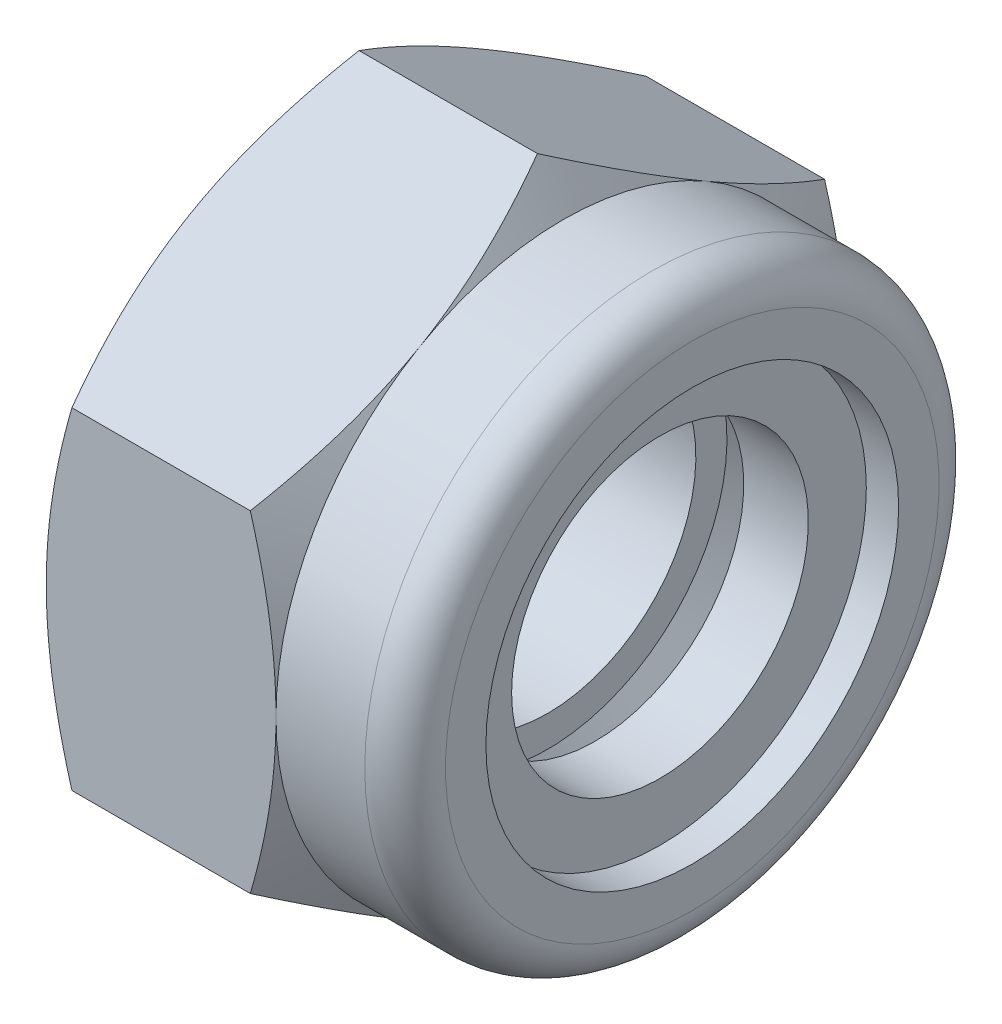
ISO-10303-21;
HEADER;
FILE_DESCRIPTION(('STEP AP214'),'2;1');
FILE_NAME('part.step','',(''),(''),'','','');
FILE_SCHEMA(('AUTOMOTIVE_DESIGN { 1 0 10303 214 1 1 1 1 }'));
ENDSEC;
DATA;
#1=APPLICATION_CONTEXT('core data for automotive mechanical design processes');
#2=APPLICATION_PROTOCOL_DEFINITION('international standard','automotive_design',2000,#1);
#3=PRODUCT_CONTEXT('',#1,'mechanical');
#4=PRODUCT('Part','Part','',(#3));
#5=PRODUCT_RELATED_PRODUCT_CATEGORY('part','',(#4));
#6=PRODUCT_DEFINITION_FORMATION('','',#4);
#7=PRODUCT_DEFINITION_CONTEXT('part definition',#1,'design');
#8=PRODUCT_DEFINITION('design','',#6,#7);
#9=PRODUCT_DEFINITION_SHAPE('','',#8);
#10=(LENGTH_UNIT() NAMED_UNIT(*) SI_UNIT(.MILLI.,.METRE.));
#11=(NAMED_UNIT(*) PLANE_ANGLE_UNIT() SI_UNIT($,.RADIAN.));
#12=(NAMED_UNIT(*) SI_UNIT($,.STERADIAN.) SOLID_ANGLE_UNIT());
#13=UNCERTAINTY_MEASURE_WITH_UNIT(LENGTH_MEASURE(1.E-05),#10,'distance_accuracy_value','');
#14=(GEOMETRIC_REPRESENTATION_CONTEXT(3) GLOBAL_UNCERTAINTY_ASSIGNED_CONTEXT((#13)) GLOBAL_UNIT_ASSIGNED_CONTEXT((#10,
#11,#12)) REPRESENTATION_CONTEXT('',''));
#15=CARTESIAN_POINT('',(0.,0.,0.));
#16=DIRECTION('',(0.,0.,1.));
#17=DIRECTION('',(1.,0.,0.));
#18=AXIS2_PLACEMENT_3D('',#15,#16,#17);
#19=CARTESIAN_POINT('',(4.48349364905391,2.471,0.));
#20=DIRECTION('',(1.,0.,0.));
#21=DIRECTION('',(0.,0.,-1.));
#22=AXIS2_PLACEMENT_3D('',#19,#20,#21);
#23=PLANE('',#22);
#24=CARTESIAN_POINT('',(4.48349364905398,0.,0.));
#25=DIRECTION('',(-1.,0.,0.));
#26=DIRECTION('',(0.,0.,1.));
#27=AXIS2_PLACEMENT_3D('',#24,#25,#26);
#28=CIRCLE('',#27,2.067);
#29=CARTESIAN_POINT('',(4.48349364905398,0.,2.06699999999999));
#30=VERTEX_POINT('',#29);
#31=EDGE_CURVE('E19',#30,#30,#28,.F.);
#32=ORIENTED_EDGE('',*,*,#31,.F.);
#33=EDGE_LOOP('',(#32));
#34=FACE_BOUND('',#33,.T.);
#35=CARTESIAN_POINT('',(4.48349364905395,0.,0.));
#36=DIRECTION('',(-1.,0.,0.));
#37=DIRECTION('',(0.,0.,1.));
#38=AXIS2_PLACEMENT_3D('',#35,#36,#37);
#39=CIRCLE('',#38,2.875);
#40=CARTESIAN_POINT('',(4.48349364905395,0.,2.87499999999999));
#41=VERTEX_POINT('',#40);
#42=EDGE_CURVE('E609',#41,#41,#39,.T.);
#43=ORIENTED_EDGE('',*,*,#42,.F.);
#44=EDGE_LOOP('',(#43));
#45=FACE_BOUND('',#44,.T.);
#46=ADVANCED_FACE('F16',(#34,#45),#23,.T.);
#47=CARTESIAN_POINT('',(4.48349364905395,0.,0.));
#48=DIRECTION('',(-1.,0.,0.));
#49=DIRECTION('',(0.,0.,1.));
#50=AXIS2_PLACEMENT_3D('',#47,#48,#49);
#51=CYLINDRICAL_SURFACE('',#50,2.067);
#52=ORIENTED_EDGE('',*,*,#31,.T.);
#53=EDGE_LOOP('',(#52));
#54=FACE_BOUND('',#53,.T.);
#55=CARTESIAN_POINT('',(3.58349364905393,0.,0.));
#56=DIRECTION('',(-1.,0.,0.));
#57=DIRECTION('',(0.,0.,1.));
#58=AXIS2_PLACEMENT_3D('',#55,#56,#57);
#59=CIRCLE('',#58,2.067);
#60=CARTESIAN_POINT('',(3.58349364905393,0.,2.06699999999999));
#61=VERTEX_POINT('',#60);
#62=EDGE_CURVE('E611',#61,#61,#59,.F.);
#63=ORIENTED_EDGE('',*,*,#62,.F.);
#64=EDGE_LOOP('',(#63));
#65=FACE_BOUND('',#64,.T.);
#66=ADVANCED_FACE('F589',(#54,#65),#51,.F.);
#67=CARTESIAN_POINT('',(4.93349364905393,0.,0.));
#68=DIRECTION('',(-1.,0.,0.));
#69=DIRECTION('',(0.,0.,1.));
#70=AXIS2_PLACEMENT_3D('',#67,#68,#69);
#71=CYLINDRICAL_SURFACE('',#70,2.875);
#72=CARTESIAN_POINT('',(4.93349364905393,0.,0.));
#73=DIRECTION('',(-1.,0.,0.));
#74=DIRECTION('',(0.,0.,1.));
#75=AXIS2_PLACEMENT_3D('',#72,#73,#74);
#76=CIRCLE('',#75,2.875);
#77=CARTESIAN_POINT('',(4.93349364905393,0.,2.87499999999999));
#78=VERTEX_POINT('',#77);
#79=EDGE_CURVE('E613',#78,#78,#76,.T.);
#80=ORIENTED_EDGE('',*,*,#79,.F.);
#81=EDGE_LOOP('',(#80));
#82=FACE_BOUND('',#81,.T.);
#83=ORIENTED_EDGE('',*,*,#42,.T.);
#84=EDGE_LOOP('',(#83));
#85=FACE_BOUND('',#84,.T.);
#86=ADVANCED_FACE('F581',(#82,#85),#71,.F.);
#87=CARTESIAN_POINT('',(3.5834936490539,2.47099999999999,0.));
#88=DIRECTION('',(-1.,0.,0.));
#89=DIRECTION('',(0.,0.,1.));
#90=AXIS2_PLACEMENT_3D('',#87,#88,#89);
#91=PLANE('',#90);
#92=CARTESIAN_POINT('',(3.58349364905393,0.,0.));
#93=DIRECTION('',(-1.,0.,0.));
#94=DIRECTION('',(0.,0.,1.));
#95=AXIS2_PLACEMENT_3D('',#92,#93,#94);
#96=CIRCLE('',#95,2.875);
#97=CARTESIAN_POINT('',(3.58349364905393,0.,2.87499999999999));
#98=VERTEX_POINT('',#97);
#99=EDGE_CURVE('E618',#98,#98,#96,.F.);
#100=ORIENTED_EDGE('',*,*,#99,.F.);
#101=EDGE_LOOP('',(#100));
#102=FACE_BOUND('',#101,.T.);
#103=ORIENTED_EDGE('',*,*,#62,.T.);
#104=EDGE_LOOP('',(#103));
#105=FACE_BOUND('',#104,.T.);
#106=ADVANCED_FACE('F574',(#102,#105),#91,.T.);
#107=CARTESIAN_POINT('',(4.93349364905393,3.15625000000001,0.));
#108=DIRECTION('',(1.,0.,0.));
#109=DIRECTION('',(0.,0.,-1.));
#110=AXIS2_PLACEMENT_3D('',#107,#108,#109);
#111=PLANE('',#110);
#112=ORIENTED_EDGE('',*,*,#79,.T.);
#113=EDGE_LOOP('',(#112));
#114=FACE_BOUND('',#113,.T.);
#115=CARTESIAN_POINT('',(4.93349364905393,0.,0.));
#116=DIRECTION('',(-1.,0.,0.));
#117=DIRECTION('',(0.,1.,0.));
#118=AXIS2_PLACEMENT_3D('',#115,#116,#117);
#119=CIRCLE('',#118,3.43750000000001);
#120=CARTESIAN_POINT('',(4.93349364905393,3.43750000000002,0.));
#121=VERTEX_POINT('',#120);
#122=EDGE_CURVE('E620',#121,#121,#119,.T.);
#123=ORIENTED_EDGE('',*,*,#122,.F.);
#124=EDGE_LOOP('',(#123));
#125=FACE_BOUND('',#124,.T.);
#126=ADVANCED_FACE('F567',(#114,#125),#111,.T.);
#127=CARTESIAN_POINT('',(3.58349364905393,0.,0.));
#128=DIRECTION('',(-1.,0.,0.));
#129=DIRECTION('',(0.,0.,1.));
#130=AXIS2_PLACEMENT_3D('',#127,#128,#129);
#131=CYLINDRICAL_SURFACE('',#130,2.875);
#132=ORIENTED_EDGE('',*,*,#99,.T.);
#133=EDGE_LOOP('',(#132));
#134=FACE_BOUND('',#133,.T.);
#135=CARTESIAN_POINT('',(3.13349364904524,0.,0.));
#136=DIRECTION('',(1.,0.,0.));
#137=DIRECTION('',(0.,1.,0.));
#138=AXIS2_PLACEMENT_3D('',#135,#136,#137);
#139=CIRCLE('',#138,2.87500000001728);
#140=CARTESIAN_POINT('',(3.13349364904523,2.87500000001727,0.));
#141=VERTEX_POINT('',#140);
#142=EDGE_CURVE('E625',#141,#141,#139,.T.);
#143=ORIENTED_EDGE('',*,*,#142,.F.);
#144=EDGE_LOOP('',(#143));
#145=FACE_BOUND('',#144,.T.);
#146=ADVANCED_FACE('F174',(#134,#145),#131,.F.);
#147=CARTESIAN_POINT('',(4.37099364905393,0.,0.));
#148=DIRECTION('',(-1.,0.,0.));
#149=DIRECTION('',(0.,0.,1.));
#150=AXIS2_PLACEMENT_3D('',#147,#148,#149);
#151=TOROIDAL_SURFACE('',#150,3.43750000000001,0.562499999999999);
#152=ORIENTED_EDGE('',*,*,#122,.T.);
#153=EDGE_LOOP('',(#152));
#154=FACE_BOUND('',#153,.T.);
#155=CARTESIAN_POINT('',(4.37099364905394,0.,0.));
#156=DIRECTION('',(-1.,0.,0.));
#157=DIRECTION('',(0.,-1.,0.));
#158=AXIS2_PLACEMENT_3D('',#155,#156,#157);
#159=CIRCLE('',#158,4.);
#160=CARTESIAN_POINT('',(4.37099364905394,-3.99999999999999,0.));
#161=VERTEX_POINT('',#160);
#162=EDGE_CURVE('E165',#161,#161,#159,.T.);
#163=ORIENTED_EDGE('',*,*,#162,.F.);
#164=EDGE_LOOP('',(#163));
#165=FACE_BOUND('',#164,.T.);
#166=ADVANCED_FACE('F168',(#154,#165),#151,.T.);
#167=CARTESIAN_POINT('',(2.91698729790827,0.,0.));
#168=DIRECTION('',(1.,0.,0.));
#169=DIRECTION('',(0.,1.,0.));
#170=AXIS2_PLACEMENT_3D('',#167,#168,#169);
#171=CONICAL_SURFACE('',#170,2.49999999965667,1.04719755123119);
#172=ORIENTED_EDGE('',*,*,#142,.T.);
#173=EDGE_LOOP('',(#172));
#174=FACE_BOUND('',#173,.T.);
#175=CARTESIAN_POINT('',(2.91698729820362,0.,0.));
#176=DIRECTION('',(1.,0.,0.));
#177=DIRECTION('',(0.,1.,0.));
#178=AXIS2_PLACEMENT_3D('',#175,#176,#177);
#179=CIRCLE('',#178,2.50000000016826);
#180=CARTESIAN_POINT('',(2.91698729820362,2.50000000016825,0.));
#181=VERTEX_POINT('',#180);
#182=EDGE_CURVE('E159',#181,#181,#179,.T.);
#183=ORIENTED_EDGE('',*,*,#182,.F.);
#184=EDGE_LOOP('',(#183));
#185=FACE_BOUND('',#184,.T.);
#186=ADVANCED_FACE('F173',(#174,#185),#171,.F.);
#187=CARTESIAN_POINT('',(3.75224364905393,0.,0.));
#188=DIRECTION('',(-1.,0.,0.));
#189=DIRECTION('',(0.,-1.,0.));
#190=AXIS2_PLACEMENT_3D('',#187,#188,#189);
#191=CYLINDRICAL_SURFACE('',#190,4.);
#192=CARTESIAN_POINT('',(3.13349364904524,0.,0.));
#193=DIRECTION('',(-1.,0.,0.));
#194=DIRECTION('',(0.,1.,0.));
#195=AXIS2_PLACEMENT_3D('',#192,#193,#194);
#196=CIRCLE('',#195,4.0000000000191);
#197=CARTESIAN_POINT('',(3.13349364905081,3.46410161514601,2.00000000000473));
#198=VERTEX_POINT('',#197);
#199=CARTESIAN_POINT('',(3.13349364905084,3.46410161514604,-2.0000000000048));
#200=VERTEX_POINT('',#199);
#201=EDGE_CURVE('E146',#198,#200,#196,.T.);
#202=ORIENTED_EDGE('',*,*,#201,.F.);
#203=CARTESIAN_POINT('',(3.13349364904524,0.,0.));
#204=DIRECTION('',(-1.,0.,0.));
#205=DIRECTION('',(0.,1.,0.));
#206=AXIS2_PLACEMENT_3D('',#203,#204,#205);
#207=CIRCLE('',#206,4.0000000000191);
#208=CARTESIAN_POINT('',(3.13349364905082,0.,4.00000000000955));
#209=VERTEX_POINT('',#208);
#210=EDGE_CURVE('E143',#209,#198,#207,.T.);
#211=ORIENTED_EDGE('',*,*,#210,.F.);
#212=CARTESIAN_POINT('',(3.13349364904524,0.,0.));
#213=DIRECTION('',(-1.,0.,0.));
#214=DIRECTION('',(0.,1.,0.));
#215=AXIS2_PLACEMENT_3D('',#212,#213,#214);
#216=CIRCLE('',#215,4.0000000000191);
#217=CARTESIAN_POINT('',(3.13349364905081,-3.46410161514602,2.00000000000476));
#218=VERTEX_POINT('',#217);
#219=EDGE_CURVE('E147',#218,#209,#216,.T.);
#220=ORIENTED_EDGE('',*,*,#219,.F.);
#221=CARTESIAN_POINT('',(3.13349364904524,0.,0.));
#222=DIRECTION('',(-1.,0.,0.));
#223=DIRECTION('',(0.,1.,0.));
#224=AXIS2_PLACEMENT_3D('',#221,#222,#223);
#225=CIRCLE('',#224,4.0000000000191);
#226=CARTESIAN_POINT('',(3.13349364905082,-3.46410161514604,-2.00000000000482));
#227=VERTEX_POINT('',#226);
#228=EDGE_CURVE('E150',#227,#218,#225,.T.);
#229=ORIENTED_EDGE('',*,*,#228,.F.);
#230=CARTESIAN_POINT('',(3.13349364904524,0.,0.));
#231=DIRECTION('',(-1.,0.,0.));
#232=DIRECTION('',(0.,1.,0.));
#233=AXIS2_PLACEMENT_3D('',#230,#231,#232);
#234=CIRCLE('',#233,4.0000000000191);
#235=CARTESIAN_POINT('',(3.13349364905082,0.,-4.00000000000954));
#236=VERTEX_POINT('',#235);
#237=EDGE_CURVE('E153',#236,#227,#234,.T.);
#238=ORIENTED_EDGE('',*,*,#237,.F.);
#239=CARTESIAN_POINT('',(3.13349364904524,0.,0.));
#240=DIRECTION('',(-1.,0.,0.));
#241=DIRECTION('',(0.,1.,0.));
#242=AXIS2_PLACEMENT_3D('',#239,#240,#241);
#243=CIRCLE('',#242,4.0000000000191);
#244=EDGE_CURVE('E109',#200,#236,#243,.T.);
#245=ORIENTED_EDGE('',*,*,#244,.F.);
#246=EDGE_LOOP('',(#202,#211,#220,#229,#238,#245));
#247=FACE_BOUND('',#246,.T.);
#248=ORIENTED_EDGE('',*,*,#162,.T.);
#249=EDGE_LOOP('',(#248));
#250=FACE_BOUND('',#249,.T.);
#251=ADVANCED_FACE('F545',(#247,#250),#191,.T.);
#252=CARTESIAN_POINT('',(2.9169872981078,2.28349999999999,0.));
#253=DIRECTION('',(1.,0.,0.));
#254=DIRECTION('',(0.,0.,-1.));
#255=AXIS2_PLACEMENT_3D('',#252,#253,#254);
#256=PLANE('',#255);
#257=CARTESIAN_POINT('',(2.91698729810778,0.,0.));
#258=DIRECTION('',(-1.,0.,0.));
#259=DIRECTION('',(0.,-1.,0.));
#260=AXIS2_PLACEMENT_3D('',#257,#258,#259);
#261=CIRCLE('',#260,2.067);
#262=CARTESIAN_POINT('',(2.91698729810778,-2.06699999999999,0.));
#263=VERTEX_POINT('',#262);
#264=EDGE_CURVE('E123',#263,#263,#261,.F.);
#265=ORIENTED_EDGE('',*,*,#264,.F.);
#266=EDGE_LOOP('',(#265));
#267=FACE_BOUND('',#266,.T.);
#268=ORIENTED_EDGE('',*,*,#182,.T.);
#269=EDGE_LOOP('',(#268));
#270=FACE_BOUND('',#269,.T.);
#271=ADVANCED_FACE('F327',(#267,#270),#256,.T.);
#272=CARTESIAN_POINT('',(2.77408446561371,0.,0.));
#273=DIRECTION('',(-1.,0.,0.));
#274=DIRECTION('',(0.,-1.,0.));
#275=AXIS2_PLACEMENT_3D('',#272,#273,#274);
#276=CONICAL_SURFACE('',#275,4.62251496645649,1.04719755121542);
#277=CARTESIAN_POINT('',(2.77622805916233,2.30940107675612,-4.00000000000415));
#278=CARTESIAN_POINT('',(2.83050805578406,2.40339320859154,-3.83720085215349));
#279=CARTESIAN_POINT('',(2.88023800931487,2.49813806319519,-3.67309795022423));
#280=CARTESIAN_POINT('',(2.96793588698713,2.68846293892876,-3.34344559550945));
#281=CARTESIAN_POINT('',(3.00596197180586,2.78403632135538,-3.17790764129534));
#282=CARTESIAN_POINT('',(3.05265154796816,2.92829837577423,-2.92803843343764));
#283=CARTESIAN_POINT('',(3.06649548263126,2.97656796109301,-2.84443305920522));
#284=CARTESIAN_POINT('',(3.09045962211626,3.07333821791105,-2.67682205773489));
#285=CARTESIAN_POINT('',(3.10057992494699,3.12183888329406,-2.59281644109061));
#286=CARTESIAN_POINT('',(3.1169189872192,3.21925069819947,-2.42409422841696));
#287=CARTESIAN_POINT('',(3.1231179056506,3.26816268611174,-2.33937618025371));
#288=CARTESIAN_POINT('',(3.13141381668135,3.36608285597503,-2.16977347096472));
#289=CARTESIAN_POINT('',(3.13350999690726,3.41509105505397,-2.08488878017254));
#290=CARTESIAN_POINT('',(3.13349364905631,3.46410161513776,-2.00000000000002));
#291=B_SPLINE_CURVE_WITH_KNOTS('',3,(#277,#278,#279,#280,#281,#282,#283,#284,#285,#286,#287,
#288,#289,#290),.UNSPECIFIED.,.F.,.F.,(4,2,2,2,2,2,4),(0.,0.587229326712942,1.17149154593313,
1.46400599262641,1.75651273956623,2.05048788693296,2.34452123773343),.UNSPECIFIED.);
#292=CARTESIAN_POINT('',(2.7762280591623,2.30940107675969,-4.0000000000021));
#293=VERTEX_POINT('',#292);
#294=EDGE_CURVE('E106',#293,#200,#291,.T.);
#295=ORIENTED_EDGE('',*,*,#294,.T.);
#296=ORIENTED_EDGE('',*,*,#244,.T.);
#297=CARTESIAN_POINT('',(3.1334936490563,0.,-4.00000000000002));
#298=CARTESIAN_POINT('',(3.13350999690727,0.0980211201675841,-4.));
#299=CARTESIAN_POINT('',(3.13141381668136,0.196037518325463,-3.99999999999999));
#300=CARTESIAN_POINT('',(3.12311790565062,0.391877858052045,-3.99999999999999));
#301=CARTESIAN_POINT('',(3.11691898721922,0.489701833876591,-3.99999999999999));
#302=CARTESIAN_POINT('',(3.10057992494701,0.684525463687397,-3.99999999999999));
#303=CARTESIAN_POINT('',(3.09045962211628,0.781526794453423,-3.99999999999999));
#304=CARTESIAN_POINT('',(3.06649548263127,0.975067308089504,-3.99999999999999));
#305=CARTESIAN_POINT('',(3.05265154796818,1.07160647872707,-3.99999999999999));
#306=CARTESIAN_POINT('',(3.00596197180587,1.36013058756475,-3.99999999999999));
#307=CARTESIAN_POINT('',(2.96793588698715,1.55127735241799,-3.99999999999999));
#308=CARTESIAN_POINT('',(2.88023800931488,1.93192710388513,-3.99999999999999));
#309=CARTESIAN_POINT('',(2.83050805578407,2.12141681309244,-3.99999999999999));
#310=CARTESIAN_POINT('',(2.77622805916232,2.30940107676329,-3.99999999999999));
#311=B_SPLINE_CURVE_WITH_KNOTS('',3,(#297,#298,#299,#300,#301,#302,#303,#304,#305,#306,#307,
#308,#309,#310),.UNSPECIFIED.,.F.,.F.,(4,2,2,2,2,2,4),(0.,0.294033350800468,0.588008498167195,
0.880515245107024,1.1730296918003,1.75729191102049,2.34452123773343),.UNSPECIFIED.);
#312=EDGE_CURVE('E103',#236,#293,#311,.T.);
#313=ORIENTED_EDGE('',*,*,#312,.T.);
#314=EDGE_LOOP('',(#295,#296,#313));
#315=FACE_BOUND('',#314,.T.);
#316=ADVANCED_FACE('F105',(#315),#276,.T.);
#317=CARTESIAN_POINT('',(2.77408446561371,0.,0.));
#318=DIRECTION('',(-1.,0.,0.));
#319=DIRECTION('',(0.,-1.,0.));
#320=AXIS2_PLACEMENT_3D('',#317,#318,#319);
#321=CONICAL_SURFACE('',#320,4.62251496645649,1.04719755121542);
#322=CARTESIAN_POINT('',(2.77622805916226,-2.30940107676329,-4.00000000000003));
#323=CARTESIAN_POINT('',(2.83050805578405,-2.12141681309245,-4.));
#324=CARTESIAN_POINT('',(2.88023800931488,-1.93192710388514,-3.99999999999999));
#325=CARTESIAN_POINT('',(2.96793588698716,-1.551277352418,-3.99999999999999));
#326=CARTESIAN_POINT('',(3.00596197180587,-1.36013058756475,-3.99999999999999));
#327=CARTESIAN_POINT('',(3.05265154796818,-1.07160647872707,-3.99999999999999));
#328=CARTESIAN_POINT('',(3.06649548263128,-0.9750673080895,-3.99999999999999));
#329=CARTESIAN_POINT('',(3.09045962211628,-0.781526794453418,-3.99999999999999));
#330=CARTESIAN_POINT('',(3.10057992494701,-0.684525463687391,-3.99999999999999));
#331=CARTESIAN_POINT('',(3.11691898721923,-0.489701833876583,-3.99999999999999));
#332=CARTESIAN_POINT('',(3.12311790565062,-0.391877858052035,-3.99999999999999));
#333=CARTESIAN_POINT('',(3.13141381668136,-0.196037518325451,-3.99999999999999));
#334=CARTESIAN_POINT('',(3.13350999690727,-0.0980211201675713,-4.));
#335=CARTESIAN_POINT('',(3.1334936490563,0.,-4.00000000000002));
#336=B_SPLINE_CURVE_WITH_KNOTS('',3,(#322,#323,#324,#325,#326,#327,#328,#329,#330,#331,#332,
#333,#334,#335),.UNSPECIFIED.,.F.,.F.,(4,2,2,2,2,2,4),(0.,0.587229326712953,1.17149154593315,
1.46400599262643,1.75651273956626,2.05048788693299,2.34452123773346),.UNSPECIFIED.);
#337=CARTESIAN_POINT('',(2.77622805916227,-2.3094010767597,-4.00000000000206));
#338=VERTEX_POINT('',#337);
#339=EDGE_CURVE('E114',#338,#236,#336,.T.);
#340=ORIENTED_EDGE('',*,*,#339,.T.);
#341=ORIENTED_EDGE('',*,*,#237,.T.);
#342=CARTESIAN_POINT('',(3.13349364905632,-3.46410161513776,-2.00000000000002));
#343=CARTESIAN_POINT('',(3.13350999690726,-3.41509105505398,-2.08488878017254));
#344=CARTESIAN_POINT('',(3.13141381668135,-3.36608285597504,-2.16977347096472));
#345=CARTESIAN_POINT('',(3.1231179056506,-3.26816268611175,-2.33937618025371));
#346=CARTESIAN_POINT('',(3.1169189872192,-3.21925069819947,-2.42409422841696));
#347=CARTESIAN_POINT('',(3.10057992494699,-3.12183888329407,-2.59281644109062));
#348=CARTESIAN_POINT('',(3.09045962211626,-3.07333821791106,-2.67682205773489));
#349=CARTESIAN_POINT('',(3.06649548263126,-2.97656796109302,-2.84443305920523));
#350=CARTESIAN_POINT('',(3.05265154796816,-2.92829837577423,-2.92803843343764));
#351=CARTESIAN_POINT('',(3.00596197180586,-2.78403632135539,-3.17790764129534));
#352=CARTESIAN_POINT('',(2.96793588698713,-2.68846293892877,-3.34344559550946));
#353=CARTESIAN_POINT('',(2.88023800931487,-2.4981380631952,-3.67309795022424));
#354=CARTESIAN_POINT('',(2.83050805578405,-2.40339320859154,-3.8372008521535));
#355=CARTESIAN_POINT('',(2.7762280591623,-2.30940107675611,-4.00000000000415));
#356=B_SPLINE_CURVE_WITH_KNOTS('',3,(#342,#343,#344,#345,#346,#347,#348,#349,#350,#351,#352,
#353,#354,#355),.UNSPECIFIED.,.F.,.F.,(4,2,2,2,2,2,4),(0.,0.294033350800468,0.588008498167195,
0.880515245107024,1.1730296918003,1.75729191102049,2.34452123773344),.UNSPECIFIED.);
#357=EDGE_CURVE('E132',#227,#338,#356,.T.);
#358=ORIENTED_EDGE('',*,*,#357,.T.);
#359=EDGE_LOOP('',(#340,#341,#358));
#360=FACE_BOUND('',#359,.T.);
#361=ADVANCED_FACE('F301',(#360),#321,.T.);
#362=CARTESIAN_POINT('',(2.77408446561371,0.,0.));
#363=DIRECTION('',(-1.,0.,0.));
#364=DIRECTION('',(0.,-1.,0.));
#365=AXIS2_PLACEMENT_3D('',#362,#363,#364);
#366=CONICAL_SURFACE('',#365,4.62251496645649,1.04719755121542);
#367=ORIENTED_EDGE('',*,*,#228,.T.);
#368=CARTESIAN_POINT('',(3.13349364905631,-3.46410161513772,2.00000000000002));
#369=CARTESIAN_POINT('',(3.13350999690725,-3.51311217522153,1.9151112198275));
#370=CARTESIAN_POINT('',(3.13141381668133,-3.56212037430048,1.83022652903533));
#371=CARTESIAN_POINT('',(3.12311790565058,-3.66004054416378,1.66062381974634));
#372=CARTESIAN_POINT('',(3.11691898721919,-3.70895253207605,1.57590577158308));
#373=CARTESIAN_POINT('',(3.10057992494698,-3.80636434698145,1.40718355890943));
#374=CARTESIAN_POINT('',(3.09045962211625,-3.85486501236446,1.32317794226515));
#375=CARTESIAN_POINT('',(3.06649548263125,-3.95163526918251,1.15556694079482));
#376=CARTESIAN_POINT('',(3.05265154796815,-3.99990485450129,1.0719615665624));
#377=CARTESIAN_POINT('',(3.00596197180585,-4.14416690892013,0.822092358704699));
#378=CARTESIAN_POINT('',(2.96793588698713,-4.23974029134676,0.656554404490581));
#379=CARTESIAN_POINT('',(2.88023800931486,-4.43006516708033,0.326902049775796));
#380=CARTESIAN_POINT('',(2.83050805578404,-4.52481002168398,0.162799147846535));
#381=CARTESIAN_POINT('',(2.7762280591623,-4.61880215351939,-4.13558076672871E-12));
#382=B_SPLINE_CURVE_WITH_KNOTS('',3,(#368,#369,#370,#371,#372,#373,#374,#375,#376,#377,#378,
#379,#380,#381),.UNSPECIFIED.,.F.,.F.,(4,2,2,2,2,2,4),(0.,0.29403335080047,0.588008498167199,
0.88051524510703,1.17302969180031,1.75729191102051,2.34452123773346),.UNSPECIFIED.);
#383=CARTESIAN_POINT('',(2.77622805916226,-4.6188021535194,0.));
#384=VERTEX_POINT('',#383);
#385=EDGE_CURVE('E277',#218,#384,#382,.T.);
#386=ORIENTED_EDGE('',*,*,#385,.T.);
#387=CARTESIAN_POINT('',(2.7762280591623,-4.61880215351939,4.10782519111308E-12));
#388=CARTESIAN_POINT('',(2.83050805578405,-4.52481002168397,-0.162799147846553));
#389=CARTESIAN_POINT('',(2.88023800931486,-4.43006516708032,-0.326902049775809));
#390=CARTESIAN_POINT('',(2.96793588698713,-4.23974029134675,-0.656554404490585));
#391=CARTESIAN_POINT('',(3.00596197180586,-4.14416690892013,-0.822092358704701));
#392=CARTESIAN_POINT('',(3.05265154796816,-3.99990485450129,-1.0719615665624));
#393=CARTESIAN_POINT('',(3.06649548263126,-3.95163526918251,-1.15556694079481));
#394=CARTESIAN_POINT('',(3.09045962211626,-3.85486501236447,-1.32317794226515));
#395=CARTESIAN_POINT('',(3.10057992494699,-3.80636434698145,-1.40718355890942));
#396=CARTESIAN_POINT('',(3.1169189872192,-3.70895253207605,-1.57590577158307));
#397=CARTESIAN_POINT('',(3.1231179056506,-3.66004054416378,-1.66062381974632));
#398=CARTESIAN_POINT('',(3.13141381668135,-3.56212037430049,-1.83022652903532));
#399=CARTESIAN_POINT('',(3.13350999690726,-3.51311217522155,-1.91511121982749));
#400=CARTESIAN_POINT('',(3.13349364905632,-3.46410161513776,-2.00000000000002));
#401=B_SPLINE_CURVE_WITH_KNOTS('',3,(#387,#388,#389,#390,#391,#392,#393,#394,#395,#396,#397,
#398,#399,#400),.UNSPECIFIED.,.F.,.F.,(4,2,2,2,2,2,4),(0.,0.58722932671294,1.17149154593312,
1.4640059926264,1.75651273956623,2.05048788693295,2.34452123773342),.UNSPECIFIED.);
#402=EDGE_CURVE('E129',#384,#227,#401,.T.);
#403=ORIENTED_EDGE('',*,*,#402,.T.);
#404=EDGE_LOOP('',(#367,#386,#403));
#405=FACE_BOUND('',#404,.T.);
#406=ADVANCED_FACE('F296',(#405),#366,.T.);
#407=CARTESIAN_POINT('',(2.77408446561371,0.,0.));
#408=DIRECTION('',(-1.,0.,0.));
#409=DIRECTION('',(0.,-1.,0.));
#410=AXIS2_PLACEMENT_3D('',#407,#408,#409);
#411=CONICAL_SURFACE('',#410,4.62251496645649,1.04719755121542);
#412=ORIENTED_EDGE('',*,*,#219,.T.);
#413=CARTESIAN_POINT('',(3.13349364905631,0.,3.99999999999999));
#414=CARTESIAN_POINT('',(3.13350999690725,-0.098021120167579,3.99999999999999));
#415=CARTESIAN_POINT('',(3.13141381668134,-0.196037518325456,3.99999999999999));
#416=CARTESIAN_POINT('',(3.12311790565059,-0.391877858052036,3.99999999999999));
#417=CARTESIAN_POINT('',(3.11691898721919,-0.489701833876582,3.99999999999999));
#418=CARTESIAN_POINT('',(3.10057992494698,-0.684525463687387,3.99999999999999));
#419=CARTESIAN_POINT('',(3.09045962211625,-0.781526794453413,3.99999999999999));
#420=CARTESIAN_POINT('',(3.06649548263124,-0.975067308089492,3.99999999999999));
#421=CARTESIAN_POINT('',(3.05265154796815,-1.07160647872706,3.99999999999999));
#422=CARTESIAN_POINT('',(3.00596197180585,-1.36013058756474,3.99999999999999));
#423=CARTESIAN_POINT('',(2.96793588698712,-1.55127735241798,3.99999999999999));
#424=CARTESIAN_POINT('',(2.88023800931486,-1.93192710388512,3.99999999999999));
#425=CARTESIAN_POINT('',(2.83050805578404,-2.12141681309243,3.99999999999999));
#426=CARTESIAN_POINT('',(2.77622805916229,-2.30940107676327,4.));
#427=B_SPLINE_CURVE_WITH_KNOTS('',3,(#413,#414,#415,#416,#417,#418,#419,#420,#421,#422,#423,
#424,#425,#426),.UNSPECIFIED.,.F.,.F.,(4,2,2,2,2,2,4),(0.,0.294033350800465,0.58800849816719,
0.880515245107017,1.17302969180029,1.75729191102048,2.34452123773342),.UNSPECIFIED.);
#428=CARTESIAN_POINT('',(2.77622805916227,-2.30940107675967,4.00000000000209));
#429=VERTEX_POINT('',#428);
#430=EDGE_CURVE('E408',#209,#429,#427,.T.);
#431=ORIENTED_EDGE('',*,*,#430,.T.);
#432=CARTESIAN_POINT('',(2.77622805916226,-2.30940107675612,4.00000000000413));
#433=CARTESIAN_POINT('',(2.83050805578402,-2.40339320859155,3.83720085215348));
#434=CARTESIAN_POINT('',(2.88023800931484,-2.4981380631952,3.67309795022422));
#435=CARTESIAN_POINT('',(2.96793588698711,-2.68846293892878,3.34344559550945));
#436=CARTESIAN_POINT('',(3.00596197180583,-2.78403632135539,3.17790764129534));
#437=CARTESIAN_POINT('',(3.05265154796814,-2.92829837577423,2.92803843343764));
#438=CARTESIAN_POINT('',(3.06649548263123,-2.97656796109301,2.84443305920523));
#439=CARTESIAN_POINT('',(3.09045962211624,-3.07333821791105,2.6768220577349));
#440=CARTESIAN_POINT('',(3.10057992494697,-3.12183888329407,2.59281644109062));
#441=CARTESIAN_POINT('',(3.11691898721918,-3.21925069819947,2.42409422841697));
#442=CARTESIAN_POINT('',(3.12311790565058,-3.26816268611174,2.33937618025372));
#443=CARTESIAN_POINT('',(3.13141381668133,-3.36608285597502,2.16977347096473));
#444=CARTESIAN_POINT('',(3.13350999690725,-3.41509105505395,2.08488878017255));
#445=CARTESIAN_POINT('',(3.13349364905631,-3.46410161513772,2.00000000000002));
#446=B_SPLINE_CURVE_WITH_KNOTS('',3,(#432,#433,#434,#435,#436,#437,#438,#439,#440,#441,#442,
#443,#444,#445),.UNSPECIFIED.,.F.,.F.,(4,2,2,2,2,2,4),(0.,0.587229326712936,1.17149154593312,
1.46400599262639,1.75651273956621,2.05048788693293,2.3445212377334),.UNSPECIFIED.);
#447=EDGE_CURVE('E284',#429,#218,#446,.T.);
#448=ORIENTED_EDGE('',*,*,#447,.T.);
#449=EDGE_LOOP('',(#412,#431,#448));
#450=FACE_BOUND('',#449,.T.);
#451=ADVANCED_FACE('F300',(#450),#411,.T.);
#452=CARTESIAN_POINT('',(2.77408446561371,0.,0.));
#453=DIRECTION('',(-1.,0.,0.));
#454=DIRECTION('',(0.,-1.,0.));
#455=AXIS2_PLACEMENT_3D('',#452,#453,#454);
#456=CONICAL_SURFACE('',#455,4.62251496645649,1.04719755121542);
#457=CARTESIAN_POINT('',(2.7762280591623,4.6188021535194,-4.12170297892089E-12));
#458=CARTESIAN_POINT('',(2.83050805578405,4.52481002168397,0.162799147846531));
#459=CARTESIAN_POINT('',(2.88023800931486,4.43006516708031,0.326902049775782));
#460=CARTESIAN_POINT('',(2.96793588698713,4.23974029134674,0.656554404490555));
#461=CARTESIAN_POINT('',(3.00596197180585,4.14416690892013,0.822092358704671));
#462=CARTESIAN_POINT('',(3.05265154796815,3.99990485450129,1.07196156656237));
#463=CARTESIAN_POINT('',(3.06649548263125,3.9516352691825,1.15556694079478));
#464=CARTESIAN_POINT('',(3.09045962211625,3.85486501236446,1.32317794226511));
#465=CARTESIAN_POINT('',(3.10057992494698,3.80636434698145,1.40718355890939));
#466=CARTESIAN_POINT('',(3.11691898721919,3.70895253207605,1.57590577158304));
#467=CARTESIAN_POINT('',(3.12311790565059,3.66004054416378,1.66062381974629));
#468=CARTESIAN_POINT('',(3.13141381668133,3.56212037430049,1.83022652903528));
#469=CARTESIAN_POINT('',(3.13350999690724,3.51311217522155,1.91511121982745));
#470=CARTESIAN_POINT('',(3.13349364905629,3.46410161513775,1.99999999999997));
#471=B_SPLINE_CURVE_WITH_KNOTS('',3,(#457,#458,#459,#460,#461,#462,#463,#464,#465,#466,#467,
#468,#469,#470),.UNSPECIFIED.,.F.,.F.,(4,2,2,2,2,2,4),(0.,0.587229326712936,1.17149154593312,
1.46400599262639,1.75651273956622,2.05048788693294,2.3445212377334),.UNSPECIFIED.);
#472=CARTESIAN_POINT('',(2.77622805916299,4.61880215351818,2.04003480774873E-12));
#473=VERTEX_POINT('',#472);
#474=EDGE_CURVE('E403',#473,#198,#471,.T.);
#475=ORIENTED_EDGE('',*,*,#474,.T.);
#476=ORIENTED_EDGE('',*,*,#201,.T.);
#477=CARTESIAN_POINT('',(3.13349364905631,3.46410161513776,-2.00000000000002));
#478=CARTESIAN_POINT('',(3.13350999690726,3.51311217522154,-1.91511121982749));
#479=CARTESIAN_POINT('',(3.13141381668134,3.56212037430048,-1.83022652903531));
#480=CARTESIAN_POINT('',(3.12311790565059,3.66004054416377,-1.66062381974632));
#481=CARTESIAN_POINT('',(3.1169189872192,3.70895253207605,-1.57590577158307));
#482=CARTESIAN_POINT('',(3.10057992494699,3.80636434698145,-1.40718355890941));
#483=CARTESIAN_POINT('',(3.09045962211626,3.85486501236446,-1.32317794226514));
#484=CARTESIAN_POINT('',(3.06649548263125,3.9516352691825,-1.1555669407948));
#485=CARTESIAN_POINT('',(3.05265154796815,3.99990485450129,-1.07196156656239));
#486=CARTESIAN_POINT('',(3.00596197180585,4.14416690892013,-0.82209235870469));
#487=CARTESIAN_POINT('',(2.96793588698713,4.23974029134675,-0.656554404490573));
#488=CARTESIAN_POINT('',(2.88023800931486,4.43006516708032,-0.326902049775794));
#489=CARTESIAN_POINT('',(2.83050805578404,4.52481002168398,-0.162799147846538));
#490=CARTESIAN_POINT('',(2.7762280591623,4.6188021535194,4.12170297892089E-12));
#491=B_SPLINE_CURVE_WITH_KNOTS('',3,(#477,#478,#479,#480,#481,#482,#483,#484,#485,#486,#487,
#488,#489,#490),.UNSPECIFIED.,.F.,.F.,(4,2,2,2,2,2,4),(0.,0.294033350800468,0.588008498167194,
0.880515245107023,1.1730296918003,1.75729191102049,2.34452123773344),.UNSPECIFIED.);
#492=EDGE_CURVE('E122',#200,#473,#491,.T.);
#493=ORIENTED_EDGE('',*,*,#492,.T.);
#494=EDGE_LOOP('',(#475,#476,#493));
#495=FACE_BOUND('',#494,.T.);
#496=ADVANCED_FACE('F428',(#495),#456,.T.);
#497=CARTESIAN_POINT('',(2.77408446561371,0.,0.));
#498=DIRECTION('',(-1.,0.,0.));
#499=DIRECTION('',(0.,-1.,0.));
#500=AXIS2_PLACEMENT_3D('',#497,#498,#499);
#501=CONICAL_SURFACE('',#500,4.62251496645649,1.04719755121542);
#502=ORIENTED_EDGE('',*,*,#210,.T.);
#503=CARTESIAN_POINT('',(3.13349364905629,3.46410161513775,1.99999999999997));
#504=CARTESIAN_POINT('',(3.13350999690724,3.41509105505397,2.08488878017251));
#505=CARTESIAN_POINT('',(3.13141381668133,3.36608285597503,2.16977347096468));
#506=CARTESIAN_POINT('',(3.12311790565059,3.26816268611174,2.33937618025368));
#507=CARTESIAN_POINT('',(3.11691898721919,3.21925069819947,2.42409422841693));
#508=CARTESIAN_POINT('',(3.10057992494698,3.12183888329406,2.59281644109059));
#509=CARTESIAN_POINT('',(3.09045962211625,3.07333821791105,2.67682205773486));
#510=CARTESIAN_POINT('',(3.06649548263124,2.97656796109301,2.8444330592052));
#511=CARTESIAN_POINT('',(3.05265154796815,2.92829837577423,2.92803843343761));
#512=CARTESIAN_POINT('',(3.00596197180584,2.78403632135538,3.17790764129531));
#513=CARTESIAN_POINT('',(2.96793588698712,2.68846293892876,3.34344559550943));
#514=CARTESIAN_POINT('',(2.88023800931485,2.49813806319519,3.67309795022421));
#515=CARTESIAN_POINT('',(2.83050805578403,2.40339320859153,3.83720085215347));
#516=CARTESIAN_POINT('',(2.77622805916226,2.30940107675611,4.00000000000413));
#517=B_SPLINE_CURVE_WITH_KNOTS('',3,(#503,#504,#505,#506,#507,#508,#509,#510,#511,#512,#513,
#514,#515,#516),.UNSPECIFIED.,.F.,.F.,(4,2,2,2,2,2,4),(0.,0.29403335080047,0.5880084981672,
0.88051524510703,1.17302969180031,1.7572919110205,2.34452123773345),.UNSPECIFIED.);
#518=CARTESIAN_POINT('',(2.77622805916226,2.30940107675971,4.00000000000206));
#519=VERTEX_POINT('',#518);
#520=EDGE_CURVE('E401',#198,#519,#517,.T.);
#521=ORIENTED_EDGE('',*,*,#520,.T.);
#522=CARTESIAN_POINT('',(2.77622805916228,2.30940107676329,3.99999999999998));
#523=CARTESIAN_POINT('',(2.83050805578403,2.12141681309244,3.99999999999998));
#524=CARTESIAN_POINT('',(2.88023800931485,1.93192710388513,3.99999999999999));
#525=CARTESIAN_POINT('',(2.96793588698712,1.55127735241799,3.99999999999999));
#526=CARTESIAN_POINT('',(3.00596197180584,1.36013058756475,3.99999999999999));
#527=CARTESIAN_POINT('',(3.05265154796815,1.07160647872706,3.99999999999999));
#528=CARTESIAN_POINT('',(3.06649548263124,0.975067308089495,3.99999999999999));
#529=CARTESIAN_POINT('',(3.09045962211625,0.781526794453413,3.99999999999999));
#530=CARTESIAN_POINT('',(3.10057992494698,0.684525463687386,3.99999999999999));
#531=CARTESIAN_POINT('',(3.11691898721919,0.48970183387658,3.99999999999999));
#532=CARTESIAN_POINT('',(3.12311790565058,0.391877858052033,3.99999999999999));
#533=CARTESIAN_POINT('',(3.13141381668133,0.196037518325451,3.99999999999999));
#534=CARTESIAN_POINT('',(3.13350999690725,0.0980211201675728,3.99999999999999));
#535=CARTESIAN_POINT('',(3.13349364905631,0.,3.99999999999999));
#536=B_SPLINE_CURVE_WITH_KNOTS('',3,(#522,#523,#524,#525,#526,#527,#528,#529,#530,#531,#532,
#533,#534,#535),.UNSPECIFIED.,.F.,.F.,(4,2,2,2,2,2,4),(0.,0.587229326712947,1.17149154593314,
1.46400599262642,1.75651273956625,2.05048788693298,2.34452123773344),.UNSPECIFIED.);
#537=EDGE_CURVE('E285',#519,#209,#536,.T.);
#538=ORIENTED_EDGE('',*,*,#537,.T.);
#539=EDGE_LOOP('',(#502,#521,#538));
#540=FACE_BOUND('',#539,.T.);
#541=ADVANCED_FACE('F431',(#540),#501,.T.);
#542=CARTESIAN_POINT('',(2.91698729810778,0.,0.));
#543=DIRECTION('',(-1.,0.,0.));
#544=DIRECTION('',(0.,-1.,0.));
#545=AXIS2_PLACEMENT_3D('',#542,#543,#544);
#546=CYLINDRICAL_SURFACE('',#545,2.067);
#547=ORIENTED_EDGE('',*,*,#264,.T.);
#548=EDGE_LOOP('',(#547));
#549=FACE_BOUND('',#548,.T.);
#550=CARTESIAN_POINT('',(0.366493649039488,0.,0.));
#551=DIRECTION('',(-1.,0.,0.));
#552=DIRECTION('',(0.,1.,0.));
#553=AXIS2_PLACEMENT_3D('',#550,#551,#552);
#554=CIRCLE('',#553,2.06700000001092);
#555=CARTESIAN_POINT('',(0.366493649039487,2.06700000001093,0.));
#556=VERTEX_POINT('',#555);
#557=EDGE_CURVE('E138',#556,#556,#554,.F.);
#558=ORIENTED_EDGE('',*,*,#557,.F.);
#559=EDGE_LOOP('',(#558));
#560=FACE_BOUND('',#559,.T.);
#561=ADVANCED_FACE('F340',(#549,#560),#546,.F.);
#562=CARTESIAN_POINT('',(5.99999999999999,4.61880215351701,0.));
#563=DIRECTION('',(0.,-0.866025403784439,0.500000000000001));
#564=DIRECTION('',(0.,-0.5,-0.866025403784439));
#565=AXIS2_PLACEMENT_3D('',#562,#563,#564);
#566=PLANE('',#565);
#567=CARTESIAN_POINT('',(0.290759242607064,4.61880212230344,-1.65451125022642E-08));
#568=CARTESIAN_POINT('',(0.236479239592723,4.52481000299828,-0.162799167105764));
#569=CARTESIAN_POINT('',(0.186749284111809,4.43006515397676,-0.326902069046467));
#570=CARTESIAN_POINT('',(0.099051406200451,4.23974028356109,-0.65655442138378));
#571=CARTESIAN_POINT('',(0.0610253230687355,4.14416690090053,-0.822092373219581));
#572=CARTESIAN_POINT('',(0.0143357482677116,3.99990484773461,-1.07196157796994));
#573=CARTESIAN_POINT('',(0.000491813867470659,3.95163526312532,-1.15556695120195));
#574=CARTESIAN_POINT('',(-0.023472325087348,3.85486500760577,-1.32317795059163));
#575=CARTESIAN_POINT('',(-0.0335926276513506,3.80636434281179,-1.40718356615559));
#576=CARTESIAN_POINT('',(-0.0499316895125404,3.70895252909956,-1.57590577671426));
#577=CARTESIAN_POINT('',(-0.0561306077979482,3.66004054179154,-1.66062382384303));
#578=CARTESIAN_POINT('',(-0.0644265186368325,3.56212037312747,-1.83022653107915));
#579=CARTESIAN_POINT('',(-0.0665226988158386,3.51311217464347,-1.91511122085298));
#580=CARTESIAN_POINT('',(-0.0665063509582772,3.46410161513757,-2.00000000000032));
#581=B_SPLINE_CURVE_WITH_KNOTS('',3,(#567,#568,#569,#570,#571,#572,#573,#574,#575,#576,#577,
#578,#579,#580),.UNSPECIFIED.,.F.,.F.,(4,2,2,2,2,2,4),(0.,0.587229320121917,1.17149153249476,
1.4640059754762,1.7565127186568,2.05048786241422,2.34452120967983),.UNSPECIFIED.);
#582=CARTESIAN_POINT('',(0.290759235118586,4.61880214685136,-1.15452508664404E-08));
#583=VERTEX_POINT('',#582);
#584=CARTESIAN_POINT('',(-0.0665063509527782,3.46410161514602,-2.00000000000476));
#585=VERTEX_POINT('',#584);
#586=EDGE_CURVE('E353',#583,#585,#581,.T.);
#587=ORIENTED_EDGE('',*,*,#586,.F.);
#588=DIRECTION('',(1.,0.,0.));
#589=VECTOR('',#588,1.);
#590=CARTESIAN_POINT('',(5.99999999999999,4.61880215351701,0.));
#591=LINE('',#590,#589);
#592=EDGE_CURVE('E405',#583,#473,#591,.T.);
#593=ORIENTED_EDGE('',*,*,#592,.T.);
#594=ORIENTED_EDGE('',*,*,#492,.F.);
#595=ORIENTED_EDGE('',*,*,#294,.F.);
#596=DIRECTION('',(1.,0.,0.));
#597=VECTOR('',#596,1.);
#598=CARTESIAN_POINT('',(6.00000000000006,2.30940107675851,-3.99999999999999));
#599=LINE('',#598,#597);
#600=CARTESIAN_POINT('',(0.290759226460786,2.30940103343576,-4.00000000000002));
#601=VERTEX_POINT('',#600);
#602=EDGE_CURVE('E113',#293,#601,#599,.F.);
#603=ORIENTED_EDGE('',*,*,#602,.T.);
#604=CARTESIAN_POINT('',(-0.0665063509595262,3.4641016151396,-2.0000000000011));
#605=CARTESIAN_POINT('',(-0.0665226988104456,3.41509105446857,-2.08488878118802));
#606=CARTESIAN_POINT('',(-0.0644265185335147,3.36608285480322,-2.16977347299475));
#607=CARTESIAN_POINT('',(-0.0561306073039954,3.26816268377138,-2.33937618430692));
#608=CARTESIAN_POINT('',(-0.0499316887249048,3.21925069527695,-2.42409423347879));
#609=CARTESIAN_POINT('',(-0.0335926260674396,3.12183887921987,-2.59281644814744));
#610=CARTESIAN_POINT('',(-0.0234723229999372,3.07333821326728,-2.67682206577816));
#611=CARTESIAN_POINT('',(0.000491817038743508,2.97656795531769,-2.84443306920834));
#612=CARTESIAN_POINT('',(0.0143357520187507,2.92829836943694,-2.92803844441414));
#613=CARTESIAN_POINT('',(0.0610253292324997,2.78403631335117,-3.17790765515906));
#614=CARTESIAN_POINT('',(0.0990514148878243,2.68846292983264,-3.34344561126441));
#615=CARTESIAN_POINT('',(0.186749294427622,2.49813805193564,-3.67309796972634));
#616=CARTESIAN_POINT('',(0.236479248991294,2.40339319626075,-3.83720087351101));
#617=CARTESIAN_POINT('',(0.2907592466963,2.30940106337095,-4.00000002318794));
#618=B_SPLINE_CURVE_WITH_KNOTS('',3,(#604,#605,#606,#607,#608,#609,#610,#611,#612,#613,#614,
#615,#616,#617),.UNSPECIFIED.,.F.,.F.,(4,2,2,2,2,2,4),(0.,0.294033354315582,0.588008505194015,
0.880515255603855,1.17302970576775,1.7572919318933,2.34452126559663),.UNSPECIFIED.);
#619=EDGE_CURVE('E344',#585,#601,#618,.T.);
#620=ORIENTED_EDGE('',*,*,#619,.F.);
#621=EDGE_LOOP('',(#587,#593,#594,#595,#603,#620));
#622=FACE_BOUND('',#621,.T.);
#623=ADVANCED_FACE('F119',(#622),#566,.F.);
#624=CARTESIAN_POINT('',(6.00000000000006,2.30940107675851,-3.99999999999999));
#625=DIRECTION('',(0.,0.,1.));
#626=DIRECTION('',(1.,0.,0.));
#627=AXIS2_PLACEMENT_3D('',#624,#625,#626);
#628=PLANE('',#627);
#629=CARTESIAN_POINT('',(0.290759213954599,2.309400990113,-4.));
#630=CARTESIAN_POINT('',(0.236479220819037,2.12141673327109,-3.99999999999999));
#631=CARTESIAN_POINT('',(0.186749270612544,1.93192703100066,-3.99999999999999));
#632=CARTESIAN_POINT('',(0.099051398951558,1.55127729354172,-3.99999999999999));
#633=CARTESIAN_POINT('',(0.0610253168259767,1.36013053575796,-3.99999999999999));
#634=CARTESIAN_POINT('',(0.0143357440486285,1.07160643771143,-3.99999999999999));
#635=CARTESIAN_POINT('',(0.000491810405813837,0.975067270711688,-3.99999999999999));
#636=CARTESIAN_POINT('',(-0.0234723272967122,0.781526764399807,-3.99999999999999));
#637=CARTESIAN_POINT('',(-0.0335926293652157,0.684525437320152,-3.99999999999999));
#638=CARTESIAN_POINT('',(-0.049931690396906,0.489701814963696,-3.99999999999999));
#639=CARTESIAN_POINT('',(-0.0561306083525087,0.391877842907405,-3.99999999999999));
#640=CARTESIAN_POINT('',(-0.0644265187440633,0.196037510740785,-3.99999999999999));
#641=CARTESIAN_POINT('',(-0.0665226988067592,0.0980211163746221,-4.));
#642=CARTESIAN_POINT('',(-0.0665063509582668,-3.60822483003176E-13,-4.00000000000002));
#643=B_SPLINE_CURVE_WITH_KNOTS('',3,(#629,#630,#631,#632,#633,#634,#635,#636,#637,#638,#639,
#640,#641,#642),.UNSPECIFIED.,.F.,.F.,(4,2,2,2,2,2,4),(0.,0.58722930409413,1.17149150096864,
1.46400593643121,1.7565126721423,2.05048780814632,2.34452114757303),.UNSPECIFIED.);
#644=CARTESIAN_POINT('',(-0.0665063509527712,0.,-4.00000000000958));
#645=VERTEX_POINT('',#644);
#646=EDGE_CURVE('E127',#601,#645,#643,.T.);
#647=ORIENTED_EDGE('',*,*,#646,.F.);
#648=ORIENTED_EDGE('',*,*,#602,.F.);
#649=ORIENTED_EDGE('',*,*,#312,.F.);
#650=ORIENTED_EDGE('',*,*,#339,.F.);
#651=DIRECTION('',(1.,0.,0.));
#652=VECTOR('',#651,1.);
#653=CARTESIAN_POINT('',(6.00000000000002,-2.30940107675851,-4.00000000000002));
#654=LINE('',#653,#652);
#655=CARTESIAN_POINT('',(0.290759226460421,-2.30940109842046,-3.99999996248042));
#656=VERTEX_POINT('',#655);
#657=EDGE_CURVE('E136',#338,#656,#654,.F.);
#658=ORIENTED_EDGE('',*,*,#657,.T.);
#659=CARTESIAN_POINT('',(-0.0665063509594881,0.,-4.00000000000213));
#660=CARTESIAN_POINT('',(-0.0665226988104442,-0.0980211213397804,-4.00000000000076));
#661=CARTESIAN_POINT('',(-0.0644265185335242,-0.1960375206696,-4.00000000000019));
#662=CARTESIAN_POINT('',(-0.0561306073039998,-0.391877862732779,-3.99999999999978));
#663=CARTESIAN_POINT('',(-0.049931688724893,-0.489701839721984,-3.99999999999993));
#664=CARTESIAN_POINT('',(-0.0335926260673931,-0.684525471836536,-4.00000000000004));
#665=CARTESIAN_POINT('',(-0.0234723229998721,-0.781526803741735,-4.));
#666=CARTESIAN_POINT('',(0.000491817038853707,-0.975067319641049,-3.99999999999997));
#667=CARTESIAN_POINT('',(0.0143357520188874,-1.07160649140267,-3.99999999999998));
#668=CARTESIAN_POINT('',(0.0610253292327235,-1.36013060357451,-4.));
#669=CARTESIAN_POINT('',(0.0990514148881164,-1.55127737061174,-3.99999999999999));
#670=CARTESIAN_POINT('',(0.186749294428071,-1.93192712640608,-3.99999999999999));
#671=CARTESIAN_POINT('',(0.23647924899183,-2.12141683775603,-3.99999999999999));
#672=CARTESIAN_POINT('',(0.290759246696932,-2.30940110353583,-4.00000000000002));
#673=B_SPLINE_CURVE_WITH_KNOTS('',3,(#659,#660,#661,#662,#663,#664,#665,#666,#667,#668,#669,
#670,#671,#672),.UNSPECIFIED.,.F.,.F.,(4,2,2,2,2,2,4),(0.,0.294033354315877,0.588008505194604,
0.880515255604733,1.17302970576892,1.75729193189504,2.34452126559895),.UNSPECIFIED.);
#674=EDGE_CURVE('E450',#645,#656,#673,.T.);
#675=ORIENTED_EDGE('',*,*,#674,.F.);
#676=EDGE_LOOP('',(#647,#648,#649,#650,#658,#675));
#677=FACE_BOUND('',#676,.T.);
#678=ADVANCED_FACE('F125',(#677),#628,.F.);
#679=CARTESIAN_POINT('',(6.00000000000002,-2.30940107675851,-4.00000000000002));
#680=DIRECTION('',(0.,0.866025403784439,0.5));
#681=DIRECTION('',(0.,-0.5,0.866025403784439));
#682=AXIS2_PLACEMENT_3D('',#679,#680,#681);
#683=PLANE('',#682);
#684=CARTESIAN_POINT('',(0.290759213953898,-2.30940112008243,-3.99999992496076));
#685=CARTESIAN_POINT('',(0.236479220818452,-2.4033932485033,-3.83720078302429));
#686=CARTESIAN_POINT('',(0.186749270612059,-2.49813809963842,-3.67309788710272));
#687=CARTESIAN_POINT('',(0.0990513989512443,-2.68846296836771,-3.34344554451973));
#688=CARTESIAN_POINT('',(0.0610253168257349,-2.78403634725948,-3.17790759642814));
#689=CARTESIAN_POINT('',(0.0143357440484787,-2.9282983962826,-2.9280383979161));
#690=CARTESIAN_POINT('',(0.000491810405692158,-2.97656797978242,-2.84443302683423));
#691=CARTESIAN_POINT('',(-0.0234723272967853,-3.07333823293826,-2.67682203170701));
#692=CARTESIAN_POINT('',(-0.0335926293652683,-3.12183889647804,-2.59281641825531));
#693=CARTESIAN_POINT('',(-0.0499316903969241,-3.21925070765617,-2.42409421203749));
#694=CARTESIAN_POINT('',(-0.0561306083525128,-3.26816269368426,-2.33937616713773));
#695=CARTESIAN_POINT('',(-0.0644265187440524,-3.36608285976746,-2.16977346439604));
#696=CARTESIAN_POINT('',(-0.0665226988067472,-3.41509105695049,-2.08488877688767));
#697=CARTESIAN_POINT('',(-0.0665063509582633,-3.46410161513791,-1.99999999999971));
#698=B_SPLINE_CURVE_WITH_KNOTS('',3,(#684,#685,#686,#687,#688,#689,#690,#691,#692,#693,#694,
#695,#696,#697),.UNSPECIFIED.,.F.,.F.,(4,2,2,2,2,2,4),(0.,0.587229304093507,1.1714915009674,
1.46400593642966,1.75651267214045,2.05048780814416,2.34452114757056),.UNSPECIFIED.);
#699=CARTESIAN_POINT('',(-0.0665063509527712,-3.46410161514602,-2.00000000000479));
#700=VERTEX_POINT('',#699);
#701=EDGE_CURVE('E452',#656,#700,#698,.T.);
#702=ORIENTED_EDGE('',*,*,#701,.F.);
#703=ORIENTED_EDGE('',*,*,#657,.F.);
#704=ORIENTED_EDGE('',*,*,#357,.F.);
#705=ORIENTED_EDGE('',*,*,#402,.F.);
#706=DIRECTION('',(1.,0.,0.));
#707=VECTOR('',#706,1.);
#708=CARTESIAN_POINT('',(6.00000000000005,-4.61880215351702,0.));
#709=LINE('',#708,#707);
#710=CARTESIAN_POINT('',(0.290759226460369,-4.61880213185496,3.75197511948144E-08));
#711=VERTEX_POINT('',#710);
#712=EDGE_CURVE('E283',#384,#711,#709,.F.);
#713=ORIENTED_EDGE('',*,*,#712,.T.);
#714=CARTESIAN_POINT('',(-0.0665063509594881,-3.46410161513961,-2.00000000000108));
#715=CARTESIAN_POINT('',(-0.066522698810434,-3.51311217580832,-1.9151112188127));
#716=CARTESIAN_POINT('',(-0.0644265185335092,-3.56212037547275,-1.83022652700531));
#717=CARTESIAN_POINT('',(-0.0561306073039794,-3.660040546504,-1.66062381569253));
#718=CARTESIAN_POINT('',(-0.0499316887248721,-3.70895253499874,-1.57590576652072));
#719=CARTESIAN_POINT('',(-0.0335926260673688,-3.80636435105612,-1.407183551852));
#720=CARTESIAN_POINT('',(-0.023472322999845,-3.8548650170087,-1.32317793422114));
#721=CARTESIAN_POINT('',(0.000491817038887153,-3.95163527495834,-1.15556693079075));
#722=CARTESIAN_POINT('',(0.0143357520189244,-3.99990486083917,-1.07196155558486));
#723=CARTESIAN_POINT('',(0.0610253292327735,-4.14416691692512,-0.822092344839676));
#724=CARTESIAN_POINT('',(0.099051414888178,-4.23974030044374,-0.656554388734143));
#725=CARTESIAN_POINT('',(0.186749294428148,-4.43006517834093,-0.32690203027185));
#726=CARTESIAN_POINT('',(0.236479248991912,-4.52481003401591,-0.16279912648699));
#727=CARTESIAN_POINT('',(0.290759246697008,-4.61880216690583,2.31901026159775E-08));
#728=B_SPLINE_CURVE_WITH_KNOTS('',3,(#714,#715,#716,#717,#718,#719,#720,#721,#722,#723,#724,
#725,#726,#727),.UNSPECIFIED.,.F.,.F.,(4,2,2,2,2,2,4),(0.,0.294033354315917,0.588008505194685,
0.880515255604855,1.17302970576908,1.75729193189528,2.34452126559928),.UNSPECIFIED.);
#729=EDGE_CURVE('E252',#700,#711,#728,.T.);
#730=ORIENTED_EDGE('',*,*,#729,.F.);
#731=EDGE_LOOP('',(#702,#703,#704,#705,#713,#730));
#732=FACE_BOUND('',#731,.T.);
#733=ADVANCED_FACE('F262',(#732),#683,.F.);
#734=CARTESIAN_POINT('',(6.00000000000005,-4.61880215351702,0.));
#735=DIRECTION('',(0.,0.866025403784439,-0.500000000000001));
#736=DIRECTION('',(0.,0.5,0.866025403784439));
#737=AXIS2_PLACEMENT_3D('',#734,#735,#736);
#738=PLANE('',#737);
#739=ORIENTED_EDGE('',*,*,#712,.F.);
#740=ORIENTED_EDGE('',*,*,#385,.F.);
#741=ORIENTED_EDGE('',*,*,#447,.F.);
#742=DIRECTION('',(-1.,0.,0.));
#743=VECTOR('',#742,1.);
#744=CARTESIAN_POINT('',(6.00000000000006,-2.30940107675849,3.99999999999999));
#745=LINE('',#744,#743);
#746=CARTESIAN_POINT('',(0.290759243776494,-2.30940109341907,3.99999999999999));
#747=VERTEX_POINT('',#746);
#748=EDGE_CURVE('E407',#429,#747,#745,.T.);
#749=ORIENTED_EDGE('',*,*,#748,.T.);
#750=CARTESIAN_POINT('',(-0.0665063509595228,-3.46410161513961,2.00000000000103));
#751=CARTESIAN_POINT('',(-0.0665226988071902,-3.41509105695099,2.08488877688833));
#752=CARTESIAN_POINT('',(-0.0644265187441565,-3.36608285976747,2.16977346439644));
#753=CARTESIAN_POINT('',(-0.0561306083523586,-3.26816269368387,2.339376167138));
#754=CARTESIAN_POINT('',(-0.0499316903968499,-3.21925070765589,2.42409421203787));
#755=CARTESIAN_POINT('',(-0.0335926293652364,-3.1218388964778,2.59281641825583));
#756=CARTESIAN_POINT('',(-0.0234723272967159,-3.07333823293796,2.67682203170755));
#757=CARTESIAN_POINT('',(0.000491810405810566,-2.97656797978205,2.84443302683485));
#758=CARTESIAN_POINT('',(0.0143357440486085,-2.92829839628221,2.92803839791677));
#759=CARTESIAN_POINT('',(0.0610253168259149,-2.78403634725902,3.17790759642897));
#760=CARTESIAN_POINT('',(0.0990513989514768,-2.68846296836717,3.34344554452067));
#761=CARTESIAN_POINT('',(0.186749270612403,-2.49813809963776,3.67309788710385));
#762=CARTESIAN_POINT('',(0.236479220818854,-2.40339324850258,3.83720078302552));
#763=CARTESIAN_POINT('',(0.290759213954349,-2.30940112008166,3.99999992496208));
#764=B_SPLINE_CURVE_WITH_KNOTS('',3,(#750,#751,#752,#753,#754,#755,#756,#757,#758,#759,#760,
#761,#762,#763),.UNSPECIFIED.,.F.,.F.,(4,2,2,2,2,2,4),(0.,0.294033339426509,0.588008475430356,
0.880515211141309,1.17302964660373,1.75729184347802,2.34452114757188),.UNSPECIFIED.);
#765=CARTESIAN_POINT('',(-0.0665063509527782,-3.46410161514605,2.00000000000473));
#766=VERTEX_POINT('',#765);
#767=EDGE_CURVE('E245',#766,#747,#764,.T.);
#768=ORIENTED_EDGE('',*,*,#767,.F.);
#769=CARTESIAN_POINT('',(0.290759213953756,-4.61880211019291,7.50395162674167E-08));
#770=CARTESIAN_POINT('',(0.236479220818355,-4.52480998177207,0.162799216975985));
#771=CARTESIAN_POINT('',(0.186749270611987,-4.43006513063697,0.326902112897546));
#772=CARTESIAN_POINT('',(0.0990513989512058,-4.23974026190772,0.656554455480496));
#773=CARTESIAN_POINT('',(0.0610253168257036,-4.14416688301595,0.822092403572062));
#774=CARTESIAN_POINT('',(0.01433574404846,-3.99990483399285,1.07196160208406));
#775=CARTESIAN_POINT('',(0.000491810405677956,-3.95163525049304,1.15556697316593));
#776=CARTESIAN_POINT('',(-0.0234723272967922,-3.85486499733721,1.32317796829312));
#777=CARTESIAN_POINT('',(-0.0335926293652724,-3.80636433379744,1.40718358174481));
#778=CARTESIAN_POINT('',(-0.0499316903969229,-3.70895252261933,1.5759057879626));
#779=CARTESIAN_POINT('',(-0.0561306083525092,-3.66004053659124,1.66062383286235));
#780=CARTESIAN_POINT('',(-0.0644265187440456,-3.56212037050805,1.83022653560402));
#781=CARTESIAN_POINT('',(-0.0665226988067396,-3.51311217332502,1.91511122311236));
#782=CARTESIAN_POINT('',(-0.0665063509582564,-3.46410161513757,2.00000000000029));
#783=B_SPLINE_CURVE_WITH_KNOTS('',3,(#769,#770,#771,#772,#773,#774,#775,#776,#777,#778,#779,
#780,#781,#782),.UNSPECIFIED.,.F.,.F.,(4,2,2,2,2,2,4),(0.,0.58722930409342,1.17149150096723,
1.46400593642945,1.75651267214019,2.05048780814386,2.34452114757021),.UNSPECIFIED.);
#784=EDGE_CURVE('E271',#711,#766,#783,.T.);
#785=ORIENTED_EDGE('',*,*,#784,.F.);
#786=EDGE_LOOP('',(#739,#740,#741,#749,#768,#785));
#787=FACE_BOUND('',#786,.T.);
#788=ADVANCED_FACE('F258',(#787),#738,.F.);
#789=CARTESIAN_POINT('',(6.00000000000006,-2.30940107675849,3.99999999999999));
#790=DIRECTION('',(0.,0.,-1.));
#791=DIRECTION('',(-1.,0.,0.));
#792=AXIS2_PLACEMENT_3D('',#789,#790,#791);
#793=PLANE('',#792);
#794=ORIENTED_EDGE('',*,*,#748,.F.);
#795=ORIENTED_EDGE('',*,*,#430,.F.);
#796=ORIENTED_EDGE('',*,*,#537,.F.);
#797=DIRECTION('',(1.,0.,0.));
#798=VECTOR('',#797,1.);
#799=CARTESIAN_POINT('',(6.00000000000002,2.3094010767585,3.99999999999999));
#800=LINE('',#799,#798);
#801=CARTESIAN_POINT('',(0.290759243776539,2.30940106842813,4.00000001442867));
#802=VERTEX_POINT('',#801);
#803=EDGE_CURVE('E142',#519,#802,#800,.F.);
#804=ORIENTED_EDGE('',*,*,#803,.T.);
#805=CARTESIAN_POINT('',(-0.0665063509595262,0.,4.00000000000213));
#806=CARTESIAN_POINT('',(-0.0665226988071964,0.0980211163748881,4.00000000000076));
#807=CARTESIAN_POINT('',(-0.064426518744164,0.196037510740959,4.0000000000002));
#808=CARTESIAN_POINT('',(-0.0561306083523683,0.391877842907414,3.99999999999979));
#809=CARTESIAN_POINT('',(-0.0499316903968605,0.489701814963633,3.99999999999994));
#810=CARTESIAN_POINT('',(-0.0335926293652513,0.684525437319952,4.00000000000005));
#811=CARTESIAN_POINT('',(-0.0234723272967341,0.781526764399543,4.00000000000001));
#812=CARTESIAN_POINT('',(0.000491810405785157,0.975067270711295,3.99999999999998));
#813=CARTESIAN_POINT('',(0.0143357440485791,1.07160643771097,3.99999999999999));
#814=CARTESIAN_POINT('',(0.0610253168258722,1.36013053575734,4.));
#815=CARTESIAN_POINT('',(0.0990513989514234,1.55127729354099,4.));
#816=CARTESIAN_POINT('',(0.186749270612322,1.93192703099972,3.99999999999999));
#817=CARTESIAN_POINT('',(0.236479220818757,2.12141673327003,3.99999999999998));
#818=CARTESIAN_POINT('',(0.290759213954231,2.30940099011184,3.99999999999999));
#819=B_SPLINE_CURVE_WITH_KNOTS('',3,(#805,#806,#807,#808,#809,#810,#811,#812,#813,#814,#815,
#816,#817,#818),.UNSPECIFIED.,.F.,.F.,(4,2,2,2,2,2,4),(0.,0.294033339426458,0.588008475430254,
0.880515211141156,1.17302964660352,1.75729184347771,2.34452114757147),.UNSPECIFIED.);
#820=CARTESIAN_POINT('',(-0.0665063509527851,0.,4.00000000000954));
#821=VERTEX_POINT('',#820);
#822=EDGE_CURVE('E34',#821,#802,#819,.T.);
#823=ORIENTED_EDGE('',*,*,#822,.F.);
#824=CARTESIAN_POINT('',(0.290759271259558,-2.30940110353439,3.999999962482));
#825=CARTESIAN_POINT('',(0.236479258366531,-2.12141684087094,3.99999998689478));
#826=CARTESIAN_POINT('',(0.186749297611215,-1.93192713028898,3.99999999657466));
#827=CARTESIAN_POINT('',(0.0990514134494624,-1.55127737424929,4.00000000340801));
#828=CARTESIAN_POINT('',(0.0610253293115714,-1.36013060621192,4.00000000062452));
#829=CARTESIAN_POINT('',(0.0143357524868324,-1.07160649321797,3.99999999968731));
#830=CARTESIAN_POINT('',(0.000491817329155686,-0.975067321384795,3.9999999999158));
#831=CARTESIAN_POINT('',(-0.0234723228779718,-0.781526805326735,4.00000000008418));
#832=CARTESIAN_POINT('',(-0.0335926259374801,-0.684525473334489,4.0000000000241));
#833=CARTESIAN_POINT('',(-0.0499316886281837,-0.489701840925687,3.99999999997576));
#834=CARTESIAN_POINT('',(-0.0561306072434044,-0.391877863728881,3.99999999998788));
#835=CARTESIAN_POINT('',(-0.0644265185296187,-0.196037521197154,4.00000000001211));
#836=CARTESIAN_POINT('',(-0.0665226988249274,-0.0980211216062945,4.00000000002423));
#837=CARTESIAN_POINT('',(-0.0665063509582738,3.53883589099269E-13,3.99999999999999));
#838=B_SPLINE_CURVE_WITH_KNOTS('',3,(#824,#825,#826,#827,#828,#829,#830,#831,#832,#833,#834,
#835,#836,#837),.UNSPECIFIED.,.F.,.F.,(4,2,2,2,2,2,4),(0.,0.587229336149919,1.17149156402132,
1.46400601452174,1.75651276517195,2.05048791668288,2.34452127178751),.UNSPECIFIED.);
#839=EDGE_CURVE('E240',#747,#821,#838,.T.);
#840=ORIENTED_EDGE('',*,*,#839,.F.);
#841=EDGE_LOOP('',(#794,#795,#796,#804,#823,#840));
#842=FACE_BOUND('',#841,.T.);
#843=ADVANCED_FACE('F261',(#842),#793,.F.);
#844=CARTESIAN_POINT('',(6.00000000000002,2.3094010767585,3.99999999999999));
#845=DIRECTION('',(0.,-0.866025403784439,-0.5));
#846=DIRECTION('',(0.,0.5,-0.866025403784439));
#847=AXIS2_PLACEMENT_3D('',#844,#845,#846);
#848=PLANE('',#847);
#849=ORIENTED_EDGE('',*,*,#803,.F.);
#850=ORIENTED_EDGE('',*,*,#520,.F.);
#851=ORIENTED_EDGE('',*,*,#474,.F.);
#852=ORIENTED_EDGE('',*,*,#592,.F.);
#853=CARTESIAN_POINT('',(-0.0665063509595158,3.4641016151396,2.00000000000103));
#854=CARTESIAN_POINT('',(-0.0665226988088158,3.51311217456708,1.91511122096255));
#855=CARTESIAN_POINT('',(-0.0644265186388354,3.56212037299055,1.83022653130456));
#856=CARTESIAN_POINT('',(-0.0561306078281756,3.66004054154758,1.66062382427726));
#857=CARTESIAN_POINT('',(-0.0499316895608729,3.70895252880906,1.57590577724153));
#858=CARTESIAN_POINT('',(-0.0335926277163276,3.80636434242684,1.40718356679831));
#859=CARTESIAN_POINT('',(-0.0234723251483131,3.85486500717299,1.32317795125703));
#860=CARTESIAN_POINT('',(0.000491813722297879,3.95163526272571,1.15556695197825));
#861=CARTESIAN_POINT('',(0.0143357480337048,3.99990484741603,1.07196157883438));
#862=CARTESIAN_POINT('',(0.061025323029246,4.14416689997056,0.8220923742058));
#863=CARTESIAN_POINT('',(0.0990514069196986,4.23974028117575,0.656554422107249));
#864=CARTESIAN_POINT('',(0.186749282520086,4.43006515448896,0.326902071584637));
#865=CARTESIAN_POINT('',(0.236479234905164,4.524810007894,0.162799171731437));
#866=CARTESIAN_POINT('',(0.290759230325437,4.61880213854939,2.5924679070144E-08));
#867=B_SPLINE_CURVE_WITH_KNOTS('',3,(#853,#854,#855,#856,#857,#858,#859,#860,#861,#862,#863,
#864,#865,#866),.UNSPECIFIED.,.F.,.F.,(4,2,2,2,2,2,4),(0.,0.294033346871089,0.588008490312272,
0.88051523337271,1.17302967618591,1.75729188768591,2.34452120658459),.UNSPECIFIED.);
#868=CARTESIAN_POINT('',(-0.0665063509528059,3.46410161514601,2.00000000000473));
#869=VERTEX_POINT('',#868);
#870=EDGE_CURVE('E141',#869,#583,#867,.T.);
#871=ORIENTED_EDGE('',*,*,#870,.F.);
#872=CARTESIAN_POINT('',(0.290759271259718,2.30940103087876,4.00000000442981));
#873=CARTESIAN_POINT('',(0.236479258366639,2.40339318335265,3.83720086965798));
#874=CARTESIAN_POINT('',(0.186749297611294,2.4981380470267,3.67309797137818));
#875=CARTESIAN_POINT('',(0.0990514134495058,2.68846293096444,3.34344561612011));
#876=CARTESIAN_POINT('',(0.0610253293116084,2.78403631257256,3.17790765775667));
#877=CARTESIAN_POINT('',(0.0143357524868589,2.92829836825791,2.9280384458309));
#878=CARTESIAN_POINT('',(0.000491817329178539,2.97656795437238,2.84443307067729));
#879=CARTESIAN_POINT('',(-0.0234723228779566,3.07333821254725,2.67682206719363));
#880=CARTESIAN_POINT('',(-0.0335926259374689,3.12183887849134,2.59281644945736));
#881=CARTESIAN_POINT('',(-0.0499316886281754,3.2192506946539,2.42409423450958));
#882=CARTESIAN_POINT('',(-0.0561306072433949,3.2681626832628,2.33937618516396));
#883=CARTESIAN_POINT('',(-0.0644265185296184,3.36608285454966,2.16977347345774));
#884=CARTESIAN_POINT('',(-0.0665226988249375,3.4150910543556,2.08488878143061));
#885=CARTESIAN_POINT('',(-0.0665063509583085,3.46410161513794,1.99999999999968));
#886=B_SPLINE_CURVE_WITH_KNOTS('',3,(#872,#873,#874,#875,#876,#877,#878,#879,#880,#881,#882,
#883,#884,#885),.UNSPECIFIED.,.F.,.F.,(4,2,2,2,2,2,4),(0.,0.587229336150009,1.1714915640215,
1.46400601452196,1.75651276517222,2.05048791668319,2.34452127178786),.UNSPECIFIED.);
#887=EDGE_CURVE('E207',#802,#869,#886,.T.);
#888=ORIENTED_EDGE('',*,*,#887,.F.);
#889=EDGE_LOOP('',(#849,#850,#851,#852,#871,#888));
#890=FACE_BOUND('',#889,.T.);
#891=ADVANCED_FACE('F220',(#890),#848,.F.);
#892=CARTESIAN_POINT('',(0.366493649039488,0.,0.));
#893=DIRECTION('',(-1.,0.,0.));
#894=DIRECTION('',(0.,-1.,0.));
#895=AXIS2_PLACEMENT_3D('',#892,#893,#894);
#896=CONICAL_SURFACE('',#895,2.06700000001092,0.785398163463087);
#897=ORIENTED_EDGE('',*,*,#557,.T.);
#898=EDGE_LOOP('',(#897));
#899=FACE_BOUND('',#898,.T.);
#900=CARTESIAN_POINT('',(-0.0665063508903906,0.,0.));
#901=DIRECTION('',(-1.,0.,0.));
#902=DIRECTION('',(0.,-1.,0.));
#903=AXIS2_PLACEMENT_3D('',#900,#901,#902);
#904=CIRCLE('',#903,2.49999999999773);
#905=CARTESIAN_POINT('',(-0.0665063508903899,-2.49999999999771,0.));
#906=VERTEX_POINT('',#905);
#907=EDGE_CURVE('E204',#906,#906,#904,.F.);
#908=ORIENTED_EDGE('',*,*,#907,.F.);
#909=EDGE_LOOP('',(#908));
#910=FACE_BOUND('',#909,.T.);
#911=ADVANCED_FACE('F371',(#899,#910),#896,.F.);
#912=CARTESIAN_POINT('',(0.292902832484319,0.,0.));
#913=DIRECTION('',(1.,0.,0.));
#914=DIRECTION('',(0.,1.,0.));
#915=AXIS2_PLACEMENT_3D('',#912,#913,#914);
#916=CONICAL_SURFACE('',#915,4.62251496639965,1.04719755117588);
#917=ORIENTED_EDGE('',*,*,#586,.T.);
#918=CARTESIAN_POINT('',(-0.066506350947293,0.,0.));
#919=DIRECTION('',(1.,0.,0.));
#920=DIRECTION('',(0.,1.,0.));
#921=AXIS2_PLACEMENT_3D('',#918,#919,#920);
#922=CIRCLE('',#921,4.0000000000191);
#923=EDGE_CURVE('E201',#869,#585,#922,.F.);
#924=ORIENTED_EDGE('',*,*,#923,.F.);
#925=ORIENTED_EDGE('',*,*,#870,.T.);
#926=EDGE_LOOP('',(#917,#924,#925));
#927=FACE_BOUND('',#926,.T.);
#928=ADVANCED_FACE('F367',(#927),#916,.T.);
#929=CARTESIAN_POINT('',(0.292902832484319,0.,0.));
#930=DIRECTION('',(1.,0.,0.));
#931=DIRECTION('',(0.,1.,0.));
#932=AXIS2_PLACEMENT_3D('',#929,#930,#931);
#933=CONICAL_SURFACE('',#932,4.62251496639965,1.04719755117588);
#934=CARTESIAN_POINT('',(-0.066506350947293,0.,0.));
#935=DIRECTION('',(1.,0.,0.));
#936=DIRECTION('',(0.,1.,0.));
#937=AXIS2_PLACEMENT_3D('',#934,#935,#936);
#938=CIRCLE('',#937,4.0000000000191);
#939=EDGE_CURVE('E198',#585,#645,#938,.F.);
#940=ORIENTED_EDGE('',*,*,#939,.F.);
#941=ORIENTED_EDGE('',*,*,#619,.T.);
#942=ORIENTED_EDGE('',*,*,#646,.T.);
#943=EDGE_LOOP('',(#940,#941,#942));
#944=FACE_BOUND('',#943,.T.);
#945=ADVANCED_FACE('F370',(#944),#933,.T.);
#946=CARTESIAN_POINT('',(0.292902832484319,0.,0.));
#947=DIRECTION('',(1.,0.,0.));
#948=DIRECTION('',(0.,1.,0.));
#949=AXIS2_PLACEMENT_3D('',#946,#947,#948);
#950=CONICAL_SURFACE('',#949,4.62251496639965,1.04719755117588);
#951=CARTESIAN_POINT('',(-0.0665063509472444,0.,0.));
#952=DIRECTION('',(1.,0.,0.));
#953=DIRECTION('',(0.,1.,0.));
#954=AXIS2_PLACEMENT_3D('',#951,#952,#953);
#955=CIRCLE('',#954,4.0000000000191);
#956=EDGE_CURVE('E195',#645,#700,#955,.F.);
#957=ORIENTED_EDGE('',*,*,#956,.F.);
#958=ORIENTED_EDGE('',*,*,#674,.T.);
#959=ORIENTED_EDGE('',*,*,#701,.T.);
#960=EDGE_LOOP('',(#957,#958,#959));
#961=FACE_BOUND('',#960,.T.);
#962=ADVANCED_FACE('F449',(#961),#950,.T.);
#963=CARTESIAN_POINT('',(0.292902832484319,0.,0.));
#964=DIRECTION('',(1.,0.,0.));
#965=DIRECTION('',(0.,1.,0.));
#966=AXIS2_PLACEMENT_3D('',#963,#964,#965);
#967=CONICAL_SURFACE('',#966,4.62251496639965,1.04719755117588);
#968=CARTESIAN_POINT('',(-0.0665063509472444,0.,0.));
#969=DIRECTION('',(1.,0.,0.));
#970=DIRECTION('',(0.,1.,0.));
#971=AXIS2_PLACEMENT_3D('',#968,#969,#970);
#972=CIRCLE('',#971,4.0000000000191);
#973=EDGE_CURVE('E192',#700,#766,#972,.F.);
#974=ORIENTED_EDGE('',*,*,#973,.F.);
#975=ORIENTED_EDGE('',*,*,#729,.T.);
#976=ORIENTED_EDGE('',*,*,#784,.T.);
#977=EDGE_LOOP('',(#974,#975,#976));
#978=FACE_BOUND('',#977,.T.);
#979=ADVANCED_FACE('F235',(#978),#967,.T.);
#980=CARTESIAN_POINT('',(0.292902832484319,0.,0.));
#981=DIRECTION('',(1.,0.,0.));
#982=DIRECTION('',(0.,1.,0.));
#983=AXIS2_PLACEMENT_3D('',#980,#981,#982);
#984=CONICAL_SURFACE('',#983,4.62251496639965,1.04719755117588);
#985=ORIENTED_EDGE('',*,*,#839,.T.);
#986=CARTESIAN_POINT('',(-0.066506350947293,0.,0.));
#987=DIRECTION('',(1.,0.,0.));
#988=DIRECTION('',(0.,1.,0.));
#989=AXIS2_PLACEMENT_3D('',#986,#987,#988);
#990=CIRCLE('',#989,4.0000000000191);
#991=EDGE_CURVE('E25',#766,#821,#990,.F.);
#992=ORIENTED_EDGE('',*,*,#991,.F.);
#993=ORIENTED_EDGE('',*,*,#767,.T.);
#994=EDGE_LOOP('',(#985,#992,#993));
#995=FACE_BOUND('',#994,.T.);
#996=ADVANCED_FACE('F229',(#995),#984,.T.);
#997=CARTESIAN_POINT('',(0.292902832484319,0.,0.));
#998=DIRECTION('',(1.,0.,0.));
#999=DIRECTION('',(0.,1.,0.));
#1000=AXIS2_PLACEMENT_3D('',#997,#998,#999);
#1001=CONICAL_SURFACE('',#1000,4.62251496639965,1.04719755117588);
#1002=ORIENTED_EDGE('',*,*,#887,.T.);
#1003=CARTESIAN_POINT('',(-0.066506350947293,0.,0.));
#1004=DIRECTION('',(1.,0.,0.));
#1005=DIRECTION('',(0.,1.,0.));
#1006=AXIS2_PLACEMENT_3D('',#1003,#1004,#1005);
#1007=CIRCLE('',#1006,4.0000000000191);
#1008=EDGE_CURVE('E11',#821,#869,#1007,.F.);
#1009=ORIENTED_EDGE('',*,*,#1008,.F.);
#1010=ORIENTED_EDGE('',*,*,#822,.T.);
#1011=EDGE_LOOP('',(#1002,#1009,#1010));
#1012=FACE_BOUND('',#1011,.T.);
#1013=ADVANCED_FACE('F223',(#1012),#1001,.T.);
#1014=CARTESIAN_POINT('',(-0.0665063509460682,3.25000000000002,0.));
#1015=DIRECTION('',(-1.,0.,0.));
#1016=DIRECTION('',(0.,-1.,0.));
#1017=AXIS2_PLACEMENT_3D('',#1014,#1015,#1016);
#1018=PLANE('',#1017);
#1019=ORIENTED_EDGE('',*,*,#991,.T.);
#1020=ORIENTED_EDGE('',*,*,#1008,.T.);
#1021=ORIENTED_EDGE('',*,*,#923,.T.);
#1022=ORIENTED_EDGE('',*,*,#939,.T.);
#1023=ORIENTED_EDGE('',*,*,#956,.T.);
#1024=ORIENTED_EDGE('',*,*,#973,.T.);
#1025=EDGE_LOOP('',(#1019,#1020,#1021,#1022,#1023,#1024));
#1026=FACE_BOUND('',#1025,.T.);
#1027=ORIENTED_EDGE('',*,*,#907,.T.);
#1028=EDGE_LOOP('',(#1027));
#1029=FACE_BOUND('',#1028,.T.);
#1030=ADVANCED_FACE('F228',(#1026,#1029),#1018,.T.);
#1031=CLOSED_SHELL('',(#46,#66,#86,#106,#126,#146,#166,#186,#251,#271,#316,#361,#406,#451,#496,
#541,#561,#623,#678,#733,#788,#843,#891,#911,#928,#945,#962,#979,#996,#1013,#1030));
#1032=MANIFOLD_SOLID_BREP('B1',#1031);
#1033=ADVANCED_BREP_SHAPE_REPRESENTATION('',(#18,#1032),#14);
#1034=SHAPE_DEFINITION_REPRESENTATION(#9,#1033);
ENDSEC;
END-ISO-10303-21;
